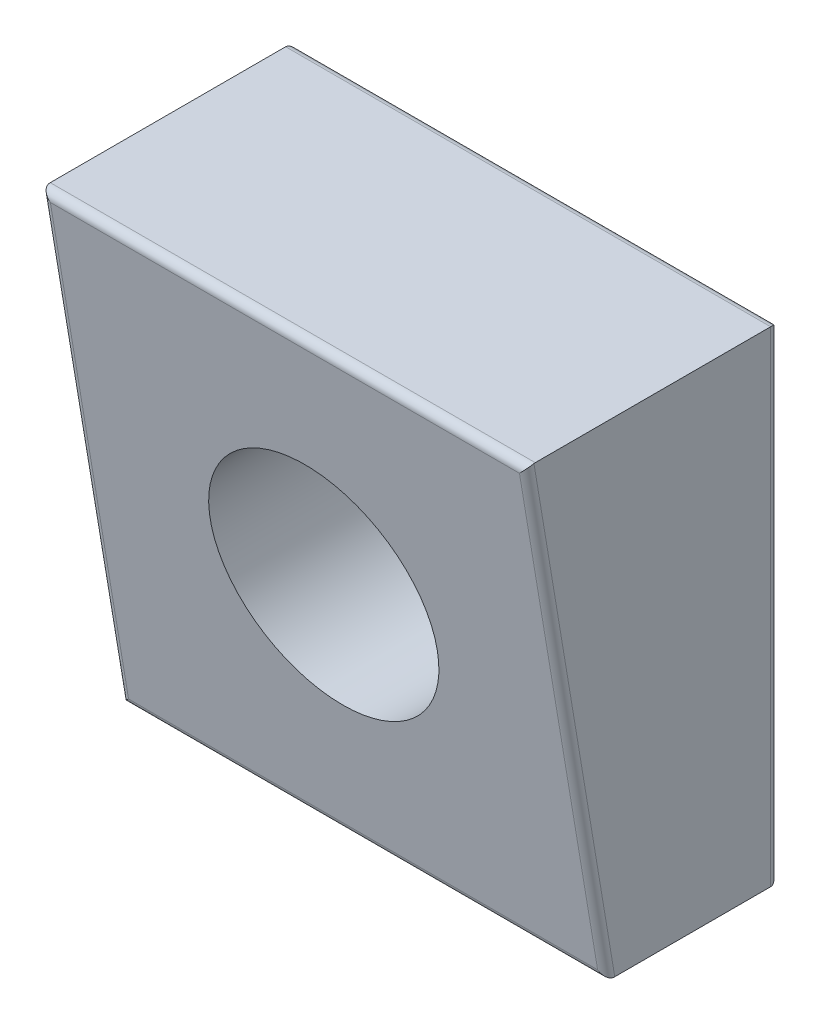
ISO-10303-21;
HEADER;
FILE_DESCRIPTION(('STEP AP214'),'2;1');
FILE_NAME('part.step','',(''),(''),'','','');
FILE_SCHEMA(('AUTOMOTIVE_DESIGN { 1 0 10303 214 1 1 1 1 }'));
ENDSEC;
DATA;
#1=APPLICATION_CONTEXT('core data for automotive mechanical design processes');
#2=APPLICATION_PROTOCOL_DEFINITION('international standard','automotive_design',2000,#1);
#3=PRODUCT_CONTEXT('',#1,'mechanical');
#4=PRODUCT('Part','Part','',(#3));
#5=PRODUCT_RELATED_PRODUCT_CATEGORY('part','',(#4));
#6=PRODUCT_DEFINITION_FORMATION('','',#4);
#7=PRODUCT_DEFINITION_CONTEXT('part definition',#1,'design');
#8=PRODUCT_DEFINITION('design','',#6,#7);
#9=PRODUCT_DEFINITION_SHAPE('','',#8);
#10=(LENGTH_UNIT() NAMED_UNIT(*) SI_UNIT(.MILLI.,.METRE.));
#11=(NAMED_UNIT(*) PLANE_ANGLE_UNIT() SI_UNIT($,.RADIAN.));
#12=(NAMED_UNIT(*) SI_UNIT($,.STERADIAN.) SOLID_ANGLE_UNIT());
#13=UNCERTAINTY_MEASURE_WITH_UNIT(LENGTH_MEASURE(1.E-05),#10,'distance_accuracy_value','');
#14=(GEOMETRIC_REPRESENTATION_CONTEXT(3) GLOBAL_UNCERTAINTY_ASSIGNED_CONTEXT((#13)) GLOBAL_UNIT_ASSIGNED_CONTEXT((#10,
#11,#12)) REPRESENTATION_CONTEXT('',''));
#15=CARTESIAN_POINT('',(0.,0.,0.));
#16=DIRECTION('',(0.,0.,1.));
#17=DIRECTION('',(1.,0.,0.));
#18=AXIS2_PLACEMENT_3D('',#15,#16,#17);
#19=CARTESIAN_POINT('',(15.24,-15.24,10.8023849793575));
#20=DIRECTION('',(0.,1.,0.));
#21=DIRECTION('',(0.,0.,1.));
#22=AXIS2_PLACEMENT_3D('',#19,#20,#21);
#23=PLANE('',#22);
#24=DIRECTION('',(0.,0.,-1.));
#25=VECTOR('',#24,1.);
#26=CARTESIAN_POINT('',(-15.24,-15.24,10.8023849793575));
#27=LINE('',#26,#25);
#28=CARTESIAN_POINT('',(-15.24,-15.24,10.2954871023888));
#29=VERTEX_POINT('',#28);
#30=CARTESIAN_POINT('',(-15.24,-15.24,0.500000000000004));
#31=VERTEX_POINT('',#30);
#32=EDGE_CURVE('E401',#29,#31,#27,.T.);
#33=ORIENTED_EDGE('',*,*,#32,.T.);
#34=DIRECTION('',(-1.,0.,0.));
#35=VECTOR('',#34,1.);
#36=CARTESIAN_POINT('',(15.24,-15.24,0.5));
#37=LINE('',#36,#35);
#38=CARTESIAN_POINT('',(15.24,-15.24,0.500000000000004));
#39=VERTEX_POINT('',#38);
#40=EDGE_CURVE('E368',#31,#39,#37,.F.);
#41=ORIENTED_EDGE('',*,*,#40,.T.);
#42=DIRECTION('',(0.,0.,-1.));
#43=VECTOR('',#42,1.);
#44=CARTESIAN_POINT('',(15.24,-15.24,10.8023849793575));
#45=LINE('',#44,#43);
#46=CARTESIAN_POINT('',(15.24,-15.24,10.2954871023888));
#47=VERTEX_POINT('',#46);
#48=EDGE_CURVE('E565',#47,#39,#45,.T.);
#49=ORIENTED_EDGE('',*,*,#48,.F.);
#50=CARTESIAN_POINT('',(14.74,-15.24,10.2954871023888));
#51=DIRECTION('',(0.,1.,0.));
#52=DIRECTION('',(0.,0.,1.));
#53=AXIS2_PLACEMENT_3D('',#50,#51,#52);
#54=ELLIPSE('',#53,0.506897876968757,0.5);
#55=CARTESIAN_POINT('',(15.2331959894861,-15.24,10.3788265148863));
#56=VERTEX_POINT('',#55);
#57=EDGE_CURVE('E341',#47,#56,#54,.F.);
#58=ORIENTED_EDGE('',*,*,#57,.T.);
#59=DIRECTION('',(-1.,0.,0.));
#60=VECTOR('',#59,1.);
#61=CARTESIAN_POINT('',(15.24,-15.24,10.3788265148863));
#62=LINE('',#61,#60);
#63=CARTESIAN_POINT('',(-15.2331959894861,-15.24,10.3788265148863));
#64=VERTEX_POINT('',#63);
#65=EDGE_CURVE('E340',#56,#64,#62,.T.);
#66=ORIENTED_EDGE('',*,*,#65,.T.);
#67=CARTESIAN_POINT('',(-14.74,-15.24,10.2954871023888));
#68=DIRECTION('',(0.,1.,0.));
#69=DIRECTION('',(0.,0.,-1.));
#70=AXIS2_PLACEMENT_3D('',#67,#68,#69);
#71=ELLIPSE('',#70,0.506897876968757,0.5);
#72=EDGE_CURVE('E333',#64,#29,#71,.F.);
#73=ORIENTED_EDGE('',*,*,#72,.T.);
#74=EDGE_LOOP('',(#33,#41,#49,#58,#66,#73));
#75=FACE_BOUND('',#74,.T.);
#76=ADVANCED_FACE('F203',(#75),#23,.F.);
#77=CARTESIAN_POINT('',(15.24,-15.24,0.));
#78=DIRECTION('',(0.,0.,1.));
#79=DIRECTION('',(0.,-1.,0.));
#80=AXIS2_PLACEMENT_3D('',#77,#78,#79);
#81=PLANE('',#80);
#82=DIRECTION('',(0.,1.,0.));
#83=VECTOR('',#82,1.);
#84=CARTESIAN_POINT('',(14.74,-15.24,0.));
#85=LINE('',#84,#83);
#86=CARTESIAN_POINT('',(14.74,14.74,0.));
#87=VERTEX_POINT('',#86);
#88=CARTESIAN_POINT('',(14.74,-14.74,0.));
#89=VERTEX_POINT('',#88);
#90=EDGE_CURVE('E358',#87,#89,#85,.F.);
#91=ORIENTED_EDGE('',*,*,#90,.T.);
#92=DIRECTION('',(-1.,0.,0.));
#93=VECTOR('',#92,1.);
#94=CARTESIAN_POINT('',(15.24,-14.74,0.));
#95=LINE('',#94,#93);
#96=CARTESIAN_POINT('',(-14.74,-14.74,0.));
#97=VERTEX_POINT('',#96);
#98=EDGE_CURVE('E362',#89,#97,#95,.T.);
#99=ORIENTED_EDGE('',*,*,#98,.T.);
#100=DIRECTION('',(0.,1.,0.));
#101=VECTOR('',#100,1.);
#102=CARTESIAN_POINT('',(-14.74,-15.24,0.));
#103=LINE('',#102,#101);
#104=CARTESIAN_POINT('',(-14.74,14.74,0.));
#105=VERTEX_POINT('',#104);
#106=EDGE_CURVE('E344',#97,#105,#103,.T.);
#107=ORIENTED_EDGE('',*,*,#106,.T.);
#108=DIRECTION('',(-1.,0.,0.));
#109=VECTOR('',#108,1.);
#110=CARTESIAN_POINT('',(15.24,14.74,0.));
#111=LINE('',#110,#109);
#112=EDGE_CURVE('E356',#105,#87,#111,.F.);
#113=ORIENTED_EDGE('',*,*,#112,.T.);
#114=EDGE_LOOP('',(#91,#99,#107,#113));
#115=FACE_BOUND('',#114,.T.);
#116=CARTESIAN_POINT('',(7.1374,0.,0.));
#117=CARTESIAN_POINT('',(7.13740908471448,0.117769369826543,0.));
#118=CARTESIAN_POINT('',(7.13459539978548,0.235544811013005,0.));
#119=CARTESIAN_POINT('',(7.12326721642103,0.469972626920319,0.));
#120=CARTESIAN_POINT('',(7.11479379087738,0.586626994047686,0.));
#121=CARTESIAN_POINT('',(7.09214829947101,0.818814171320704,0.));
#122=CARTESIAN_POINT('',(7.07800397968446,0.934349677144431,0.));
#123=CARTESIAN_POINT('',(7.04403331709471,1.16429773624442,0.));
#124=CARTESIAN_POINT('',(7.02422077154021,1.27871232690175,0.));
#125=CARTESIAN_POINT('',(6.97892702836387,1.50641970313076,0.));
#126=CARTESIAN_POINT('',(6.95344555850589,1.61971243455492,0.));
#127=CARTESIAN_POINT('',(6.89682846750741,1.84517837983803,0.));
#128=CARTESIAN_POINT('',(6.86567878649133,1.95734806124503,0.));
#129=CARTESIAN_POINT('',(6.79773842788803,2.1805716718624,0.));
#130=CARTESIAN_POINT('',(6.76092058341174,2.29161732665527,0.));
#131=CARTESIAN_POINT('',(6.68165877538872,2.51259778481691,0.));
#132=CARTESIAN_POINT('',(6.63917559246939,2.62251850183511,0.));
#133=CARTESIAN_POINT('',(6.54904177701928,2.84015827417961,0.));
#134=CARTESIAN_POINT('',(6.50139365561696,2.94787836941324,0.));
#135=CARTESIAN_POINT('',(6.40124613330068,3.16010271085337,0.));
#136=CARTESIAN_POINT('',(6.34878378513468,3.2646244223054,0.));
#137=CARTESIAN_POINT('',(6.2390223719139,3.4704552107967,0.));
#138=CARTESIAN_POINT('',(6.18174767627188,3.57177727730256,0.));
#139=CARTESIAN_POINT('',(6.06237399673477,3.77121360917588,0.));
#140=CARTESIAN_POINT('',(6.00028675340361,3.86933490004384,0.));
#141=CARTESIAN_POINT('',(5.87130081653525,4.06237593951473,0.));
#142=CARTESIAN_POINT('',(5.80440166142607,4.15729537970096,0.));
#143=CARTESIAN_POINT('',(5.66580419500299,4.34394039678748,0.));
#144=CARTESIAN_POINT('',(5.5940940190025,4.43565716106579,0.));
#145=CARTESIAN_POINT('',(5.4458852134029,4.615905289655,0.));
#146=CARTESIAN_POINT('',(5.36936443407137,4.70441843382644,0.));
#147=CARTESIAN_POINT('',(5.21154652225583,4.87826980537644,0.));
#148=CARTESIAN_POINT('',(5.13021834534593,4.96357982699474,0.));
#149=CARTESIAN_POINT('',(4.963643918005,5.13017366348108,0.));
#150=CARTESIAN_POINT('',(4.87840025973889,5.21146007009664,0.));
#151=CARTESIAN_POINT('',(4.70466139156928,5.36920511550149,0.));
#152=CARTESIAN_POINT('',(4.61619373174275,5.44569407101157,0.));
#153=CARTESIAN_POINT('',(4.43601934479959,5.59385301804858,0.));
#154=CARTESIAN_POINT('',(4.34433016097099,5.66554433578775,0.));
#155=CARTESIAN_POINT('',(4.15772229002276,5.80411715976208,0.));
#156=CARTESIAN_POINT('',(4.06281176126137,5.87100964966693,0.));
#157=CARTESIAN_POINT('',(3.8697706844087,5.99999553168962,0.));
#158=CARTESIAN_POINT('',(3.77163982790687,6.062088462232,0.));
#159=CARTESIAN_POINT('',(3.57216651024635,6.18148701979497,0.));
#160=CARTESIAN_POINT('',(3.47081645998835,6.23877996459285,0.));
#161=CARTESIAN_POINT('',(3.26491140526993,6.34859046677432,0.));
#162=CARTESIAN_POINT('',(3.16034290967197,6.40108271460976,0.));
#163=CARTESIAN_POINT('',(2.94800813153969,6.50130613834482,0.));
#164=CARTESIAN_POINT('',(2.84022396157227,6.54899937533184,0.));
#165=CARTESIAN_POINT('',(2.62257655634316,6.63916673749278,0.));
#166=CARTESIAN_POINT('',(2.51271472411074,6.68164424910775,0.));
#167=CARTESIAN_POINT('',(2.29183452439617,6.76089468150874,0.));
#168=CARTESIAN_POINT('',(2.18083000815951,6.79770615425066,0.));
#169=CARTESIAN_POINT('',(1.95767260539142,6.86563742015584,0.));
#170=CARTESIAN_POINT('',(1.84552776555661,6.89678362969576,0.));
#171=CARTESIAN_POINT('',(1.62009504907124,6.95339648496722,0.));
#172=CARTESIAN_POINT('',(1.50681050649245,6.97887640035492,0.));
#173=CARTESIAN_POINT('',(1.2791030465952,7.0241701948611,0.));
#174=CARTESIAN_POINT('',(1.16468002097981,7.04398352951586,0.));
#175=CARTESIAN_POINT('',(0.93469885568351,7.07795827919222,0.));
#176=CARTESIAN_POINT('',(0.819138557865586,7.09210507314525,0.));
#177=CARTESIAN_POINT('',(0.586884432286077,7.11476029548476,0.));
#178=CARTESIAN_POINT('',(0.470187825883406,7.1232401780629,0.));
#179=CARTESIAN_POINT('',(0.235662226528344,7.13457754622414,0.));
#180=CARTESIAN_POINT('',(0.11783122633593,7.13739313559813,0.));
#181=CARTESIAN_POINT('',(-0.117754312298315,7.13740685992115,0.));
#182=CARTESIAN_POINT('',(-0.235508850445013,7.13460866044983,0.));
#183=CARTESIAN_POINT('',(-0.469903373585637,7.12329931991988,0.));
#184=CARTESIAN_POINT('',(-0.586545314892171,7.1148290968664,0.));
#185=CARTESIAN_POINT('',(-0.818712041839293,7.09219076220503,0.));
#186=CARTESIAN_POINT('',(-0.934239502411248,7.07805013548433,0.));
#187=CARTESIAN_POINT('',(-1.16417697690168,7.04408422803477,0.));
#188=CARTESIAN_POINT('',(-1.27858898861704,7.02427248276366,0.));
#189=CARTESIAN_POINT('',(-1.50629643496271,6.97897862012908,0.));
#190=CARTESIAN_POINT('',(-1.61959176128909,6.95349595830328,0.));
#191=CARTESIAN_POINT('',(-1.84506822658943,6.89687455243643,0.));
#192=CARTESIAN_POINT('',(-1.9572457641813,6.86572147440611,0.));
#193=CARTESIAN_POINT('',(-2.18049037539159,6.79777236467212,0.));
#194=CARTESIAN_POINT('',(-2.29154909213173,6.76094889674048,0.));
#195=CARTESIAN_POINT('',(-2.51256111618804,6.68167419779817,0.));
#196=CARTESIAN_POINT('',(-2.62250024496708,6.63918349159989,0.));
#197=CARTESIAN_POINT('',(-2.84015815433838,6.54904148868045,0.));
#198=CARTESIAN_POINT('',(-2.94787833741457,6.50139357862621,0.));
#199=CARTESIAN_POINT('',(-3.1601027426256,6.40124620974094,0.));
#200=CARTESIAN_POINT('',(-3.26462443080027,6.34878380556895,0.));
#201=CARTESIAN_POINT('',(-3.47045520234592,6.2390223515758,0.));
#202=CARTESIAN_POINT('',(-3.5717772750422,6.18174767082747,0.));
#203=CARTESIAN_POINT('',(-3.7712136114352,6.06237400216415,0.));
#204=CARTESIAN_POINT('',(-3.86933490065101,6.00028675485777,0.));
#205=CARTESIAN_POINT('',(-4.06237593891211,5.87130081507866,0.));
#206=CARTESIAN_POINT('',(-4.15729537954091,5.80440166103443,0.));
#207=CARTESIAN_POINT('',(-4.34394039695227,5.66580419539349,0.));
#208=CARTESIAN_POINT('',(-4.43565716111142,5.59409401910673,0.));
#209=CARTESIAN_POINT('',(-4.61590528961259,5.44588521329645,0.));
#210=CARTESIAN_POINT('',(-4.70441843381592,5.36936443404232,0.));
#211=CARTESIAN_POINT('',(-4.87826980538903,5.21154652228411,0.));
#212=CARTESIAN_POINT('',(-4.96357982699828,5.13021834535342,0.));
#213=CARTESIAN_POINT('',(-5.13017366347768,4.96364391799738,0.));
#214=CARTESIAN_POINT('',(-5.21146007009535,4.87840025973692,0.));
#215=CARTESIAN_POINT('',(-5.3692051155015,4.70466139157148,0.));
#216=CARTESIAN_POINT('',(-5.4456940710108,4.61619373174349,0.));
#217=CARTESIAN_POINT('',(-5.59385301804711,4.4360193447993,0.));
#218=CARTESIAN_POINT('',(-5.66554433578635,4.34433016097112,0.));
#219=CARTESIAN_POINT('',(-5.80411715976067,4.15772229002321,0.));
#220=CARTESIAN_POINT('',(-5.87100964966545,4.06281176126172,0.));
#221=CARTESIAN_POINT('',(-5.9999955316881,3.86977068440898,0.));
#222=CARTESIAN_POINT('',(-6.06208846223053,3.77163982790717,0.));
#223=CARTESIAN_POINT('',(-6.18148701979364,3.57216651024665,0.));
#224=CARTESIAN_POINT('',(-6.2387799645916,3.47081645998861,0.));
#225=CARTESIAN_POINT('',(-6.34859046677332,3.26491140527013,0.));
#226=CARTESIAN_POINT('',(-6.40108271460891,3.16034290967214,0.));
#227=CARTESIAN_POINT('',(-6.50130613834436,2.94800813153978,0.));
#228=CARTESIAN_POINT('',(-6.54899937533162,2.84022396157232,0.));
#229=CARTESIAN_POINT('',(-6.63916673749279,2.62257655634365,0.));
#230=CARTESIAN_POINT('',(-6.68164424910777,2.51271472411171,0.));
#231=CARTESIAN_POINT('',(-6.76089468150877,2.29183452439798,0.));
#232=CARTESIAN_POINT('',(-6.79770615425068,2.18083000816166,0.));
#233=CARTESIAN_POINT('',(-6.86563742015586,1.95767260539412,0.));
#234=CARTESIAN_POINT('',(-6.89678362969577,1.84552776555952,0.));
#235=CARTESIAN_POINT('',(-6.95339648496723,1.62009504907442,0.));
#236=CARTESIAN_POINT('',(-6.97887640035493,1.5068105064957,0.));
#237=CARTESIAN_POINT('',(-7.02417019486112,1.27910304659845,0.));
#238=CARTESIAN_POINT('',(-7.04398352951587,1.16468002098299,0.));
#239=CARTESIAN_POINT('',(-7.07795827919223,0.934698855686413,0.));
#240=CARTESIAN_POINT('',(-7.09210507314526,0.819138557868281,0.));
#241=CARTESIAN_POINT('',(-7.11476029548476,0.586884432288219,0.));
#242=CARTESIAN_POINT('',(-7.1232401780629,0.470187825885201,0.));
#243=CARTESIAN_POINT('',(-7.13457754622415,0.23566222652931,0.));
#244=CARTESIAN_POINT('',(-7.13739313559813,0.117831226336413,0.));
#245=CARTESIAN_POINT('',(-7.13740685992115,-0.117754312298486,0.));
#246=CARTESIAN_POINT('',(-7.13460866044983,-0.235508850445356,0.));
#247=CARTESIAN_POINT('',(-7.12329931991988,-0.469903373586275,0.));
#248=CARTESIAN_POINT('',(-7.11482909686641,-0.586545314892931,0.));
#249=CARTESIAN_POINT('',(-7.09219076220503,-0.818712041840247,0.));
#250=CARTESIAN_POINT('',(-7.07805013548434,-0.934239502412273,0.));
#251=CARTESIAN_POINT('',(-7.04408422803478,-1.1641769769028,0.));
#252=CARTESIAN_POINT('',(-7.02427248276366,-1.27858898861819,0.));
#253=CARTESIAN_POINT('',(-6.97897862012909,-1.50629643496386,0.));
#254=CARTESIAN_POINT('',(-6.95349595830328,-1.61959176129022,0.));
#255=CARTESIAN_POINT('',(-6.89687455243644,-1.84506822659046,0.));
#256=CARTESIAN_POINT('',(-6.86572147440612,-1.95724576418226,0.));
#257=CARTESIAN_POINT('',(-6.79777236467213,-2.18049037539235,0.));
#258=CARTESIAN_POINT('',(-6.76094889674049,-2.29154909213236,0.));
#259=CARTESIAN_POINT('',(-6.68167419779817,-2.51256111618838,0.));
#260=CARTESIAN_POINT('',(-6.63918349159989,-2.62250024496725,0.));
#261=CARTESIAN_POINT('',(-6.54904148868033,-2.8401581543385,0.));
#262=CARTESIAN_POINT('',(-6.50139357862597,-2.94787833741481,0.));
#263=CARTESIAN_POINT('',(-6.40124620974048,-3.16010274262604,0.));
#264=CARTESIAN_POINT('',(-6.34878380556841,-3.26462443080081,0.));
#265=CARTESIAN_POINT('',(-6.23902235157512,-3.47045520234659,0.));
#266=CARTESIAN_POINT('',(-6.18174767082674,-3.57177727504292,0.));
#267=CARTESIAN_POINT('',(-6.06237400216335,-3.77121361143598,0.));
#268=CARTESIAN_POINT('',(-6.00028675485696,-3.86933490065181,0.));
#269=CARTESIAN_POINT('',(-5.87130081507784,-4.06237593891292,0.));
#270=CARTESIAN_POINT('',(-5.80440166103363,-4.1572953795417,0.));
#271=CARTESIAN_POINT('',(-5.66580419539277,-4.34394039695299,0.));
#272=CARTESIAN_POINT('',(-5.59409401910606,-4.43565716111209,0.));
#273=CARTESIAN_POINT('',(-5.44588521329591,-4.61590528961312,0.));
#274=CARTESIAN_POINT('',(-5.36936443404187,-4.70441843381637,0.));
#275=CARTESIAN_POINT('',(-5.21154652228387,-4.87826980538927,0.));
#276=CARTESIAN_POINT('',(-5.1302183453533,-4.96357982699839,0.));
#277=CARTESIAN_POINT('',(-4.96364391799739,-5.13017366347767,0.));
#278=CARTESIAN_POINT('',(-4.87840025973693,-5.21146007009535,0.));
#279=CARTESIAN_POINT('',(-4.70466139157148,-5.3692051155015,0.));
#280=CARTESIAN_POINT('',(-4.6161937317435,-5.4456940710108,0.));
#281=CARTESIAN_POINT('',(-4.43601934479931,-5.59385301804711,0.));
#282=CARTESIAN_POINT('',(-4.34433016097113,-5.66554433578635,0.));
#283=CARTESIAN_POINT('',(-4.15772229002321,-5.80411715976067,0.));
#284=CARTESIAN_POINT('',(-4.06281176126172,-5.87100964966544,0.));
#285=CARTESIAN_POINT('',(-3.86977068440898,-5.9999955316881,0.));
#286=CARTESIAN_POINT('',(-3.77163982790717,-6.06208846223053,0.));
#287=CARTESIAN_POINT('',(-3.57216651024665,-6.18148701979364,0.));
#288=CARTESIAN_POINT('',(-3.47081645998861,-6.2387799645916,0.));
#289=CARTESIAN_POINT('',(-3.26491140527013,-6.34859046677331,0.));
#290=CARTESIAN_POINT('',(-3.16034290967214,-6.40108271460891,0.));
#291=CARTESIAN_POINT('',(-2.94800813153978,-6.50130613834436,0.));
#292=CARTESIAN_POINT('',(-2.84022396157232,-6.54899937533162,0.));
#293=CARTESIAN_POINT('',(-2.62257655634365,-6.63916673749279,0.));
#294=CARTESIAN_POINT('',(-2.51271472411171,-6.68164424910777,0.));
#295=CARTESIAN_POINT('',(-2.29183452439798,-6.76089468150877,0.));
#296=CARTESIAN_POINT('',(-2.18083000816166,-6.79770615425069,0.));
#297=CARTESIAN_POINT('',(-1.95767260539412,-6.86563742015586,0.));
#298=CARTESIAN_POINT('',(-1.84552776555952,-6.89678362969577,0.));
#299=CARTESIAN_POINT('',(-1.62009504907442,-6.95339648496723,0.));
#300=CARTESIAN_POINT('',(-1.5068105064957,-6.97887640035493,0.));
#301=CARTESIAN_POINT('',(-1.27910304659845,-7.02417019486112,0.));
#302=CARTESIAN_POINT('',(-1.16468002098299,-7.04398352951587,0.));
#303=CARTESIAN_POINT('',(-0.934698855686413,-7.07795827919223,0.));
#304=CARTESIAN_POINT('',(-0.819138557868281,-7.09210507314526,0.));
#305=CARTESIAN_POINT('',(-0.586884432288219,-7.11476029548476,0.));
#306=CARTESIAN_POINT('',(-0.470187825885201,-7.1232401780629,0.));
#307=CARTESIAN_POINT('',(-0.23566222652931,-7.13457754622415,0.));
#308=CARTESIAN_POINT('',(-0.117831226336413,-7.13739313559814,0.));
#309=CARTESIAN_POINT('',(0.117754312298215,-7.13740685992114,0.));
#310=CARTESIAN_POINT('',(0.235508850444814,-7.13460866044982,0.));
#311=CARTESIAN_POINT('',(0.469903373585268,-7.12329931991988,0.));
#312=CARTESIAN_POINT('',(0.586545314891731,-7.1148290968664,0.));
#313=CARTESIAN_POINT('',(0.818712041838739,-7.09219076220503,0.));
#314=CARTESIAN_POINT('',(0.93423950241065,-7.07805013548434,0.));
#315=CARTESIAN_POINT('',(1.16417697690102,-7.04408422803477,0.));
#316=CARTESIAN_POINT('',(1.27858898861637,-7.02427248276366,0.));
#317=CARTESIAN_POINT('',(1.50629643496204,-6.97897862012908,0.));
#318=CARTESIAN_POINT('',(1.61959176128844,-6.95349595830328,0.));
#319=CARTESIAN_POINT('',(1.84506822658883,-6.89687455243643,0.));
#320=CARTESIAN_POINT('',(1.95724576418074,-6.8657214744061,0.));
#321=CARTESIAN_POINT('',(2.18049037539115,-6.79777236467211,0.));
#322=CARTESIAN_POINT('',(2.29154909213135,-6.76094889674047,0.));
#323=CARTESIAN_POINT('',(2.51256111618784,-6.68167419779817,0.));
#324=CARTESIAN_POINT('',(2.62250024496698,-6.6391834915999,0.));
#325=CARTESIAN_POINT('',(2.84015815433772,-6.54904148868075,0.));
#326=CARTESIAN_POINT('',(2.94787833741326,-6.50139357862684,0.));
#327=CARTESIAN_POINT('',(3.16010274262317,-6.40124620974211,0.));
#328=CARTESIAN_POINT('',(3.26462443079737,-6.34878380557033,0.));
#329=CARTESIAN_POINT('',(3.47045520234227,-6.23902235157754,0.));
#330=CARTESIAN_POINT('',(3.57177727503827,-6.18174767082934,0.));
#331=CARTESIAN_POINT('',(3.77121361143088,-6.06237400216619,0.));
#332=CARTESIAN_POINT('',(3.86933490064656,-6.00028675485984,0.));
#333=CARTESIAN_POINT('',(4.06237593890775,-5.87130081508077,0.));
#334=CARTESIAN_POINT('',(4.15729537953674,-5.80440166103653,0.));
#335=CARTESIAN_POINT('',(4.34394039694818,-5.6658041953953,0.));
#336=CARTESIAN_POINT('',(4.43565716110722,-5.59409401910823,0.));
#337=CARTESIAN_POINT('',(4.61590528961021,-5.44588521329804,0.));
#338=CARTESIAN_POINT('',(4.70441843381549,-5.36936443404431,0.));
#339=CARTESIAN_POINT('',(4.87826980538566,-5.21154652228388,0.));
#340=CARTESIAN_POINT('',(4.96357982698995,-5.13021834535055,0.));
#341=CARTESIAN_POINT('',(5.13017366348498,-4.96364391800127,0.));
#342=CARTESIAN_POINT('',(5.21146007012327,-4.87840025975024,0.));
#343=CARTESIAN_POINT('',(5.36920511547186,-4.70466139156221,0.));
#344=CARTESIAN_POINT('',(5.44569407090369,-4.61619373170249,0.));
#345=CARTESIAN_POINT('',(5.59385301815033,-4.43601934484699,0.));
#346=CARTESIAN_POINT('',(5.66554433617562,-4.34433016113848,0.));
#347=CARTESIAN_POINT('',(5.80411715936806,-4.15772228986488,0.));
#348=CARTESIAN_POINT('',(5.87100964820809,-4.06281176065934,0.));
#349=CARTESIAN_POINT('',(5.99999553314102,-3.86977068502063,0.));
#350=CARTESIAN_POINT('',(6.06208846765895,-3.77163983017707,0.));
#351=CARTESIAN_POINT('',(6.18148701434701,-3.57216650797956,0.));
#352=CARTESIAN_POINT('',(6.23877994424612,-3.47081645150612,0.));
#353=CARTESIAN_POINT('',(6.3485904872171,-3.2649114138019,0.));
#354=CARTESIAN_POINT('',(6.40108279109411,-3.16034294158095,0.));
#355=CARTESIAN_POINT('',(6.50130606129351,-2.94800809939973,0.));
#356=CARTESIAN_POINT('',(6.5489990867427,-2.84022384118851,0.));
#357=CARTESIAN_POINT('',(6.63917464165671,-2.62255829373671,0.));
#358=CARTESIAN_POINT('',(6.68165968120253,-2.51267804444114,0.));
#359=CARTESIAN_POINT('',(6.7609230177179,-2.29176626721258,0.));
#360=CARTESIAN_POINT('',(6.79774012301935,-2.18074868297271,0.));
#361=CARTESIAN_POINT('',(6.86568013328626,-1.95757027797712,0.));
#362=CARTESIAN_POINT('',(6.89682972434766,-1.84541758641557,0.));
#363=CARTESIAN_POINT('',(6.95344694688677,-1.61997432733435,0.));
#364=CARTESIAN_POINT('',(6.97892812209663,-1.50668716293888,0.));
#365=CARTESIAN_POINT('',(7.02422185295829,-1.27897970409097,0.));
#366=CARTESIAN_POINT('',(7.04403413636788,-1.16455935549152,0.));
#367=CARTESIAN_POINT('',(7.0780048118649,-0.934588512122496,0.));
#368=CARTESIAN_POINT('',(7.09214884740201,-0.819035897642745,0.));
#369=CARTESIAN_POINT('',(7.1147943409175,-0.586803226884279,0.));
#370=CARTESIAN_POINT('',(7.12326749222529,-0.470120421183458,0.));
#371=CARTESIAN_POINT('',(7.13459566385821,-0.235624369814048,0.));
#372=CARTESIAN_POINT('',(7.13740906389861,-0.117809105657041,0.));
#373=CARTESIAN_POINT('',(7.1374,0.,0.));
#374=B_SPLINE_CURVE_WITH_KNOTS('',3,(#116,#117,#118,#119,#120,#121,#122,#123,#124,#125,#126,
#127,#128,#129,#130,#131,#132,#133,#134,#135,#136,#137,#138,#139,#140,#141,#142,#143,#144,#145,
#146,#147,#148,#149,#150,#151,#152,#153,#154,#155,#156,#157,#158,#159,#160,#161,#162,#163,#164,
#165,#166,#167,#168,#169,#170,#171,#172,#173,#174,#175,#176,#177,#178,#179,#180,#181,#182,#183,
#184,#185,#186,#187,#188,#189,#190,#191,#192,#193,#194,#195,#196,#197,#198,#199,#200,#201,#202,
#203,#204,#205,#206,#207,#208,#209,#210,#211,#212,#213,#214,#215,#216,#217,#218,#219,#220,#221,
#222,#223,#224,#225,#226,#227,#228,#229,#230,#231,#232,#233,#234,#235,#236,#237,#238,#239,#240,
#241,#242,#243,#244,#245,#246,#247,#248,#249,#250,#251,#252,#253,#254,#255,#256,#257,#258,#259,
#260,#261,#262,#263,#264,#265,#266,#267,#268,#269,#270,#271,#272,#273,#274,#275,#276,#277,#278,
#279,#280,#281,#282,#283,#284,#285,#286,#287,#288,#289,#290,#291,#292,#293,#294,#295,#296,#297,
#298,#299,#300,#301,#302,#303,#304,#305,#306,#307,#308,#309,#310,#311,#312,#313,#314,#315,#316,
#317,#318,#319,#320,#321,#322,#323,#324,#325,#326,#327,#328,#329,#330,#331,#332,#333,#334,#335,
#336,#337,#338,#339,#340,#341,#342,#343,#344,#345,#346,#347,#348,#349,#350,#351,#352,#353,#354,
#355,#356,#357,#358,#359,#360,#361,#362,#363,#364,#365,#366,#367,#368,#369,#370,#371,#372,#373),
.UNSPECIFIED.,.F.,.F.,(4,2,2,2,2,2,2,2,2,2,2,2,2,2,2,2,2,2,2,2,2,2,2,2,2,2,2,2,2,2,2,2,2,2,2,2,
2,2,2,2,2,2,2,2,2,2,2,2,2,2,2,2,2,2,2,2,2,2,2,2,2,2,2,2,2,2,2,2,2,2,2,2,2,2,2,2,2,2,2,2,2,2,2,2,
2,2,2,2,2,2,2,2,2,2,2,2,2,2,2,2,2,2,2,2,2,2,2,2,2,2,2,2,2,2,2,2,2,2,2,2,2,2,2,2,2,2,2,2,4),(0.,
0.353282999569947,0.704029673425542,1.05308078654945,1.40128938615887,1.74951471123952,
2.09861587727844,2.44944556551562,2.80284394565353,3.15607127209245,3.50677747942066,
3.8558039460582,4.20400422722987,4.55223795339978,4.90136450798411,5.25223671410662,
5.60569475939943,5.95892208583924,6.30962829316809,6.658654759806,7.00685504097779,
7.35508876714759,7.70421532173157,8.05508752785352,8.40854557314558,8.76177289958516,
9.11247910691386,9.4615055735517,9.80970585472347,10.1579395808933,10.5070661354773,
10.8579383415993,11.2113963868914,11.5646237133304,11.9153299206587,12.2643563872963,
12.612556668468,12.9607903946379,13.3099169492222,13.6607891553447,14.0142472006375,
14.3674745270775,14.7181807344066,15.0672072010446,15.4154074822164,15.7636412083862,
16.11276776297,16.4636399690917,16.8170980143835,17.1703253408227,17.5210315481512,
17.8700580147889,18.2182582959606,18.5664920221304,18.9156185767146,19.2664907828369,
19.6199488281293,19.9731761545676,20.3238823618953,20.6729088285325,21.0211091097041,
21.3693428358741,21.7184693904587,22.0693415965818,22.4227996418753,22.7760269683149,
23.1267331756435,23.4757596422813,23.8239599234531,24.1721936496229,24.521320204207,
24.8721924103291,25.2256504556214,25.578877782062,25.9295839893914,26.2786104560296,
26.6268107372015,26.9750444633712,27.3241710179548,27.6750432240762,28.0285012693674,
28.3817285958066,28.7324348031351,29.0814612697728,29.4296615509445,29.7778952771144,
30.1270218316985,30.4778940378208,30.8313520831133,31.1845794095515,31.5352856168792,
31.8843120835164,32.232512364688,32.580746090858,32.9298726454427,33.2807448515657,
33.6342028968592,33.987430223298,34.338136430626,34.6871628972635,35.0353631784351,
35.3835969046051,35.7327234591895,36.0835956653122,36.4370537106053,36.7902810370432,
37.1409872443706,37.4900137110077,37.8382139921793,38.1864477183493,38.5355742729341,
38.8864464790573,39.2399045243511,39.5931318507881,39.943838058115,40.2928645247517,
40.6410648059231,40.9892985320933,41.3384250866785,41.6892972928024,42.0427553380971,
42.3960423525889,42.7467910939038,43.0958429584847,43.4440516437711,43.7922770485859,
44.1413789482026,44.4922106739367,44.8456130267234),.UNSPECIFIED.);
#375=CARTESIAN_POINT('',(7.1374,0.,0.));
#376=VERTEX_POINT('',#375);
#377=EDGE_CURVE('E355',#376,#376,#374,.T.);
#378=ORIENTED_EDGE('',*,*,#377,.T.);
#379=EDGE_LOOP('',(#378));
#380=FACE_BOUND('',#379,.T.);
#381=ADVANCED_FACE('F415',(#115,#380),#81,.F.);
#382=CARTESIAN_POINT('',(15.24,15.24,0.));
#383=DIRECTION('',(0.,-1.,0.));
#384=DIRECTION('',(0.,0.,-1.));
#385=AXIS2_PLACEMENT_3D('',#382,#383,#384);
#386=PLANE('',#385);
#387=DIRECTION('',(0.,0.,1.));
#388=VECTOR('',#387,1.);
#389=CARTESIAN_POINT('',(15.24,15.24,0.));
#390=LINE('',#389,#388);
#391=CARTESIAN_POINT('',(15.24,15.24,0.500000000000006));
#392=VERTEX_POINT('',#391);
#393=CARTESIAN_POINT('',(15.24,15.24,15.2925182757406));
#394=VERTEX_POINT('',#393);
#395=EDGE_CURVE('E308',#392,#394,#390,.T.);
#396=ORIENTED_EDGE('',*,*,#395,.F.);
#397=DIRECTION('',(-1.,0.,0.));
#398=VECTOR('',#397,1.);
#399=CARTESIAN_POINT('',(15.24,15.24,0.500000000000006));
#400=LINE('',#399,#398);
#401=CARTESIAN_POINT('',(-15.24,15.24,0.500000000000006));
#402=VERTEX_POINT('',#401);
#403=EDGE_CURVE('E211',#392,#402,#400,.T.);
#404=ORIENTED_EDGE('',*,*,#403,.T.);
#405=DIRECTION('',(0.,0.,1.));
#406=VECTOR('',#405,1.);
#407=CARTESIAN_POINT('',(-15.24,15.24,0.));
#408=LINE('',#407,#406);
#409=CARTESIAN_POINT('',(-15.24,15.24,15.2925182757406));
#410=VERTEX_POINT('',#409);
#411=EDGE_CURVE('E404',#402,#410,#408,.T.);
#412=ORIENTED_EDGE('',*,*,#411,.T.);
#413=DIRECTION('',(-1.,0.,0.));
#414=VECTOR('',#413,1.);
#415=CARTESIAN_POINT('',(15.24,15.24,15.2925182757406));
#416=LINE('',#415,#414);
#417=EDGE_CURVE('E324',#410,#394,#416,.F.);
#418=ORIENTED_EDGE('',*,*,#417,.T.);
#419=EDGE_LOOP('',(#396,#404,#412,#418));
#420=FACE_BOUND('',#419,.T.);
#421=ADVANCED_FACE('F416',(#420),#386,.F.);
#422=CARTESIAN_POINT('',(15.24,15.24,15.8827555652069));
#423=DIRECTION('',(0.,0.164410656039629,-0.986391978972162));
#424=DIRECTION('',(0.,0.986391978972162,0.164410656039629));
#425=AXIS2_PLACEMENT_3D('',#422,#423,#424);
#426=PLANE('',#425);
#427=DIRECTION('',(0.,-0.986391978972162,-0.164410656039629));
#428=VECTOR('',#427,1.);
#429=CARTESIAN_POINT('',(14.74,15.24,15.8827555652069));
#430=LINE('',#429,#428);
#431=CARTESIAN_POINT('',(14.74,-14.8222053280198,10.8720225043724));
#432=VERTEX_POINT('',#431);
#433=CARTESIAN_POINT('',(14.74,14.6577946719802,15.7857142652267));
#434=VERTEX_POINT('',#433);
#435=EDGE_CURVE('E313',#432,#434,#430,.F.);
#436=ORIENTED_EDGE('',*,*,#435,.T.);
#437=DIRECTION('',(-1.,0.,0.));
#438=VECTOR('',#437,1.);
#439=CARTESIAN_POINT('',(15.24,14.6577946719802,15.7857142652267));
#440=LINE('',#439,#438);
#441=CARTESIAN_POINT('',(-14.74,14.6577946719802,15.7857142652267));
#442=VERTEX_POINT('',#441);
#443=EDGE_CURVE('E287',#434,#442,#440,.T.);
#444=ORIENTED_EDGE('',*,*,#443,.T.);
#445=DIRECTION('',(0.,-0.986391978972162,-0.164410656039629));
#446=VECTOR('',#445,1.);
#447=CARTESIAN_POINT('',(-14.74,15.24,15.8827555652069));
#448=LINE('',#447,#446);
#449=CARTESIAN_POINT('',(-14.74,-14.8222053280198,10.8720225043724));
#450=VERTEX_POINT('',#449);
#451=EDGE_CURVE('E299',#442,#450,#448,.T.);
#452=ORIENTED_EDGE('',*,*,#451,.T.);
#453=DIRECTION('',(-1.,0.,0.));
#454=VECTOR('',#453,1.);
#455=CARTESIAN_POINT('',(15.24,-14.8222053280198,10.8720225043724));
#456=LINE('',#455,#454);
#457=EDGE_CURVE('E305',#450,#432,#456,.F.);
#458=ORIENTED_EDGE('',*,*,#457,.T.);
#459=EDGE_LOOP('',(#436,#444,#452,#458));
#460=FACE_BOUND('',#459,.T.);
#461=CARTESIAN_POINT('',(0.,0.,13.3425702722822));
#462=DIRECTION('',(0.,0.164410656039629,-0.986391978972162));
#463=DIRECTION('',(0.,-0.986391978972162,-0.164410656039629));
#464=AXIS2_PLACEMENT_3D('',#461,#462,#463);
#465=ELLIPSE('',#464,7.23586581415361,7.1374);
#466=CARTESIAN_POINT('',(0.,-7.1374,12.1529168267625));
#467=VERTEX_POINT('',#466);
#468=EDGE_CURVE('E406',#467,#467,#465,.F.);
#469=ORIENTED_EDGE('',*,*,#468,.F.);
#470=EDGE_LOOP('',(#469));
#471=FACE_BOUND('',#470,.T.);
#472=ADVANCED_FACE('F306',(#460,#471),#426,.F.);
#473=CARTESIAN_POINT('',(15.24,0.,0.));
#474=DIRECTION('',(1.,0.,0.));
#475=DIRECTION('',(0.,0.,-1.));
#476=AXIS2_PLACEMENT_3D('',#473,#474,#475);
#477=PLANE('',#476);
#478=ORIENTED_EDGE('',*,*,#48,.T.);
#479=DIRECTION('',(0.,1.,0.));
#480=VECTOR('',#479,1.);
#481=CARTESIAN_POINT('',(15.24,15.24,0.500000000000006));
#482=LINE('',#481,#480);
#483=EDGE_CURVE('E227',#39,#392,#482,.T.);
#484=ORIENTED_EDGE('',*,*,#483,.T.);
#485=ORIENTED_EDGE('',*,*,#395,.T.);
#486=CARTESIAN_POINT('',(15.24,14.74,15.2925182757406));
#487=DIRECTION('',(1.,0.,0.));
#488=DIRECTION('',(0.,0.,-1.));
#489=AXIS2_PLACEMENT_3D('',#486,#487,#488);
#490=CIRCLE('',#489,0.5);
#491=CARTESIAN_POINT('',(15.24,15.2331959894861,15.3747236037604));
#492=VERTEX_POINT('',#491);
#493=EDGE_CURVE('E335',#394,#492,#490,.T.);
#494=ORIENTED_EDGE('',*,*,#493,.T.);
#495=DIRECTION('',(0.,-0.986391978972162,-0.164410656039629));
#496=VECTOR('',#495,1.);
#497=CARTESIAN_POINT('',(15.24,-15.1577946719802,10.3091889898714));
#498=LINE('',#497,#496);
#499=EDGE_CURVE('E328',#492,#47,#498,.T.);
#500=ORIENTED_EDGE('',*,*,#499,.T.);
#501=EDGE_LOOP('',(#478,#484,#485,#494,#500));
#502=FACE_BOUND('',#501,.T.);
#503=ADVANCED_FACE('F472',(#502),#477,.T.);
#504=CARTESIAN_POINT('',(-15.24,0.,0.));
#505=DIRECTION('',(1.,0.,0.));
#506=DIRECTION('',(0.,0.,-1.));
#507=AXIS2_PLACEMENT_3D('',#504,#505,#506);
#508=PLANE('',#507);
#509=ORIENTED_EDGE('',*,*,#411,.F.);
#510=DIRECTION('',(0.,1.,0.));
#511=VECTOR('',#510,1.);
#512=CARTESIAN_POINT('',(-15.24,0.,0.500000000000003));
#513=LINE('',#512,#511);
#514=EDGE_CURVE('E12',#402,#31,#513,.F.);
#515=ORIENTED_EDGE('',*,*,#514,.T.);
#516=ORIENTED_EDGE('',*,*,#32,.F.);
#517=DIRECTION('',(0.,-0.986391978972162,-0.164410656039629));
#518=VECTOR('',#517,1.);
#519=CARTESIAN_POINT('',(-15.24,-2.08160402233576,12.4887130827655));
#520=LINE('',#519,#518);
#521=CARTESIAN_POINT('',(-15.24,15.2331959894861,15.3747236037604));
#522=VERTEX_POINT('',#521);
#523=EDGE_CURVE('E314',#29,#522,#520,.F.);
#524=ORIENTED_EDGE('',*,*,#523,.T.);
#525=CARTESIAN_POINT('',(-15.24,14.74,15.2925182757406));
#526=DIRECTION('',(1.,0.,0.));
#527=DIRECTION('',(0.,0.,-1.));
#528=AXIS2_PLACEMENT_3D('',#525,#526,#527);
#529=CIRCLE('',#528,0.5);
#530=EDGE_CURVE('E290',#522,#410,#529,.F.);
#531=ORIENTED_EDGE('',*,*,#530,.T.);
#532=EDGE_LOOP('',(#509,#515,#516,#524,#531));
#533=FACE_BOUND('',#532,.T.);
#534=ADVANCED_FACE('F405',(#533),#508,.F.);
#535=CARTESIAN_POINT('',(0.,0.,15.8827555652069));
#536=DIRECTION('',(0.,0.,-1.));
#537=DIRECTION('',(-1.,0.,0.));
#538=AXIS2_PLACEMENT_3D('',#535,#536,#537);
#539=CYLINDRICAL_SURFACE('',#538,7.1374);
#540=ORIENTED_EDGE('',*,*,#377,.F.);
#541=EDGE_LOOP('',(#540));
#542=FACE_BOUND('',#541,.T.);
#543=ORIENTED_EDGE('',*,*,#468,.T.);
#544=EDGE_LOOP('',(#543));
#545=FACE_BOUND('',#544,.T.);
#546=ADVANCED_FACE('F454',(#542,#545),#539,.F.);
#547=CARTESIAN_POINT('',(15.24,-14.74,10.3788265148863));
#548=DIRECTION('',(-1.,0.,0.));
#549=DIRECTION('',(0.,0.,1.));
#550=AXIS2_PLACEMENT_3D('',#547,#548,#549);
#551=CYLINDRICAL_SURFACE('',#550,0.5);
#552=CARTESIAN_POINT('',(-14.74,-14.74,10.3788265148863));
#553=DIRECTION('',(0.707106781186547,-0.697484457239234,-0.116255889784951));
#554=DIRECTION('',(-0.707106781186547,-0.697484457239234,-0.116255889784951));
#555=AXIS2_PLACEMENT_3D('',#552,#553,#554);
#556=ELLIPSE('',#555,0.707106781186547,0.5);
#557=EDGE_CURVE('E301',#64,#450,#556,.F.);
#558=ORIENTED_EDGE('',*,*,#557,.F.);
#559=ORIENTED_EDGE('',*,*,#65,.F.);
#560=CARTESIAN_POINT('',(14.74,-14.74,10.3788265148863));
#561=DIRECTION('',(-0.707106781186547,-0.697484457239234,-0.116255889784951));
#562=DIRECTION('',(-0.707106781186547,0.697484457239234,0.116255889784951));
#563=AXIS2_PLACEMENT_3D('',#560,#561,#562);
#564=ELLIPSE('',#563,0.707106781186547,0.5);
#565=EDGE_CURVE('E349',#432,#56,#564,.F.);
#566=ORIENTED_EDGE('',*,*,#565,.F.);
#567=ORIENTED_EDGE('',*,*,#457,.F.);
#568=EDGE_LOOP('',(#558,#559,#566,#567));
#569=FACE_BOUND('',#568,.T.);
#570=ADVANCED_FACE('F446',(#569),#551,.T.);
#571=CARTESIAN_POINT('',(14.74,-2.08160402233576,12.4887130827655));
#572=DIRECTION('',(0.,0.986391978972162,0.164410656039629));
#573=DIRECTION('',(0.,-0.164410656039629,0.986391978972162));
#574=AXIS2_PLACEMENT_3D('',#571,#572,#573);
#575=CYLINDRICAL_SURFACE('',#574,0.5);
#576=ORIENTED_EDGE('',*,*,#57,.F.);
#577=ORIENTED_EDGE('',*,*,#499,.F.);
#578=CARTESIAN_POINT('',(14.74,14.74,15.2925182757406));
#579=DIRECTION('',(-0.707106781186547,0.697484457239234,0.116255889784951));
#580=DIRECTION('',(0.707106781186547,0.697484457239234,0.116255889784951));
#581=AXIS2_PLACEMENT_3D('',#578,#579,#580);
#582=ELLIPSE('',#581,0.707106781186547,0.5);
#583=EDGE_CURVE('E294',#434,#492,#582,.T.);
#584=ORIENTED_EDGE('',*,*,#583,.F.);
#585=ORIENTED_EDGE('',*,*,#435,.F.);
#586=ORIENTED_EDGE('',*,*,#565,.T.);
#587=EDGE_LOOP('',(#576,#577,#584,#585,#586));
#588=FACE_BOUND('',#587,.T.);
#589=ADVANCED_FACE('F447',(#588),#575,.T.);
#590=CARTESIAN_POINT('',(-14.74,15.3222053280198,15.3895595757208));
#591=DIRECTION('',(0.,-0.986391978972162,-0.164410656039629));
#592=DIRECTION('',(0.,0.164410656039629,-0.986391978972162));
#593=AXIS2_PLACEMENT_3D('',#590,#591,#592);
#594=CYLINDRICAL_SURFACE('',#593,0.5);
#595=ORIENTED_EDGE('',*,*,#557,.T.);
#596=ORIENTED_EDGE('',*,*,#451,.F.);
#597=CARTESIAN_POINT('',(-14.74,14.74,15.2925182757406));
#598=DIRECTION('',(-0.707106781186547,-0.697484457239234,-0.116255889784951));
#599=DIRECTION('',(0.707106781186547,-0.697484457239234,-0.116255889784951));
#600=AXIS2_PLACEMENT_3D('',#597,#598,#599);
#601=ELLIPSE('',#600,0.707106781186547,0.5);
#602=EDGE_CURVE('E282',#522,#442,#601,.F.);
#603=ORIENTED_EDGE('',*,*,#602,.F.);
#604=ORIENTED_EDGE('',*,*,#523,.F.);
#605=ORIENTED_EDGE('',*,*,#72,.F.);
#606=EDGE_LOOP('',(#595,#596,#603,#604,#605));
#607=FACE_BOUND('',#606,.T.);
#608=ADVANCED_FACE('F300',(#607),#594,.T.);
#609=CARTESIAN_POINT('',(15.24,14.74,15.2925182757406));
#610=DIRECTION('',(-1.,0.,0.));
#611=DIRECTION('',(0.,0.,1.));
#612=AXIS2_PLACEMENT_3D('',#609,#610,#611);
#613=CYLINDRICAL_SURFACE('',#612,0.5);
#614=ORIENTED_EDGE('',*,*,#493,.F.);
#615=ORIENTED_EDGE('',*,*,#417,.F.);
#616=ORIENTED_EDGE('',*,*,#530,.F.);
#617=ORIENTED_EDGE('',*,*,#602,.T.);
#618=ORIENTED_EDGE('',*,*,#443,.F.);
#619=ORIENTED_EDGE('',*,*,#583,.T.);
#620=EDGE_LOOP('',(#614,#615,#616,#617,#618,#619));
#621=FACE_BOUND('',#620,.T.);
#622=ADVANCED_FACE('F281',(#621),#613,.T.);
#623=CARTESIAN_POINT('',(15.24,14.74,0.500000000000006));
#624=DIRECTION('',(-1.,0.,0.));
#625=DIRECTION('',(0.,0.,1.));
#626=AXIS2_PLACEMENT_3D('',#623,#624,#625);
#627=CYLINDRICAL_SURFACE('',#626,0.5);
#628=CARTESIAN_POINT('',(-14.74,14.74,0.500000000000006));
#629=DIRECTION('',(0.707106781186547,0.707106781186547,0.));
#630=DIRECTION('',(-0.707106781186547,0.707106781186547,0.));
#631=AXIS2_PLACEMENT_3D('',#628,#629,#630);
#632=ELLIPSE('',#631,0.707106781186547,0.5);
#633=EDGE_CURVE('E377',#402,#105,#632,.F.);
#634=ORIENTED_EDGE('',*,*,#633,.F.);
#635=ORIENTED_EDGE('',*,*,#403,.F.);
#636=CARTESIAN_POINT('',(14.74,14.74,0.500000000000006));
#637=DIRECTION('',(-0.707106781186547,0.707106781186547,0.));
#638=DIRECTION('',(-0.707106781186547,-0.707106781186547,0.));
#639=AXIS2_PLACEMENT_3D('',#636,#637,#638);
#640=ELLIPSE('',#639,0.707106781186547,0.5);
#641=EDGE_CURVE('E202',#87,#392,#640,.F.);
#642=ORIENTED_EDGE('',*,*,#641,.F.);
#643=ORIENTED_EDGE('',*,*,#112,.F.);
#644=EDGE_LOOP('',(#634,#635,#642,#643));
#645=FACE_BOUND('',#644,.T.);
#646=ADVANCED_FACE('F201',(#645),#627,.T.);
#647=CARTESIAN_POINT('',(14.74,0.,0.500000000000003));
#648=DIRECTION('',(0.,-1.,0.));
#649=DIRECTION('',(0.,0.,-1.));
#650=AXIS2_PLACEMENT_3D('',#647,#648,#649);
#651=CYLINDRICAL_SURFACE('',#650,0.5);
#652=ORIENTED_EDGE('',*,*,#641,.T.);
#653=ORIENTED_EDGE('',*,*,#483,.F.);
#654=CARTESIAN_POINT('',(14.74,-14.74,0.5));
#655=DIRECTION('',(-0.707106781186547,-0.707106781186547,0.));
#656=DIRECTION('',(0.707106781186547,-0.707106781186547,0.));
#657=AXIS2_PLACEMENT_3D('',#654,#655,#656);
#658=ELLIPSE('',#657,0.707106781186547,0.5);
#659=EDGE_CURVE('E380',#89,#39,#658,.T.);
#660=ORIENTED_EDGE('',*,*,#659,.F.);
#661=ORIENTED_EDGE('',*,*,#90,.F.);
#662=EDGE_LOOP('',(#652,#653,#660,#661));
#663=FACE_BOUND('',#662,.T.);
#664=ADVANCED_FACE('F395',(#663),#651,.T.);
#665=CARTESIAN_POINT('',(-14.74,-15.24,0.5));
#666=DIRECTION('',(0.,1.,0.));
#667=DIRECTION('',(0.,0.,1.));
#668=AXIS2_PLACEMENT_3D('',#665,#666,#667);
#669=CYLINDRICAL_SURFACE('',#668,0.5);
#670=ORIENTED_EDGE('',*,*,#633,.T.);
#671=ORIENTED_EDGE('',*,*,#106,.F.);
#672=CARTESIAN_POINT('',(-14.74,-14.74,0.5));
#673=DIRECTION('',(-0.707106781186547,0.707106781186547,0.));
#674=DIRECTION('',(0.707106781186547,0.707106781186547,0.));
#675=AXIS2_PLACEMENT_3D('',#672,#673,#674);
#676=ELLIPSE('',#675,0.707106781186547,0.5);
#677=EDGE_CURVE('E372',#31,#97,#676,.F.);
#678=ORIENTED_EDGE('',*,*,#677,.F.);
#679=ORIENTED_EDGE('',*,*,#514,.F.);
#680=EDGE_LOOP('',(#670,#671,#678,#679));
#681=FACE_BOUND('',#680,.T.);
#682=ADVANCED_FACE('F399',(#681),#669,.T.);
#683=CARTESIAN_POINT('',(15.24,-14.74,0.5));
#684=DIRECTION('',(-1.,0.,0.));
#685=DIRECTION('',(0.,0.,1.));
#686=AXIS2_PLACEMENT_3D('',#683,#684,#685);
#687=CYLINDRICAL_SURFACE('',#686,0.5);
#688=ORIENTED_EDGE('',*,*,#659,.T.);
#689=ORIENTED_EDGE('',*,*,#40,.F.);
#690=ORIENTED_EDGE('',*,*,#677,.T.);
#691=ORIENTED_EDGE('',*,*,#98,.F.);
#692=EDGE_LOOP('',(#688,#689,#690,#691));
#693=FACE_BOUND('',#692,.T.);
#694=ADVANCED_FACE('F412',(#693),#687,.T.);
#695=CLOSED_SHELL('',(#76,#381,#421,#472,#503,#534,#546,#570,#589,#608,#622,#646,#664,#682,#694));
#696=MANIFOLD_SOLID_BREP('B2',#695);
#697=ADVANCED_BREP_SHAPE_REPRESENTATION('',(#18,#696),#14);
#698=SHAPE_DEFINITION_REPRESENTATION(#9,#697);
ENDSEC;
END-ISO-10303-21;
